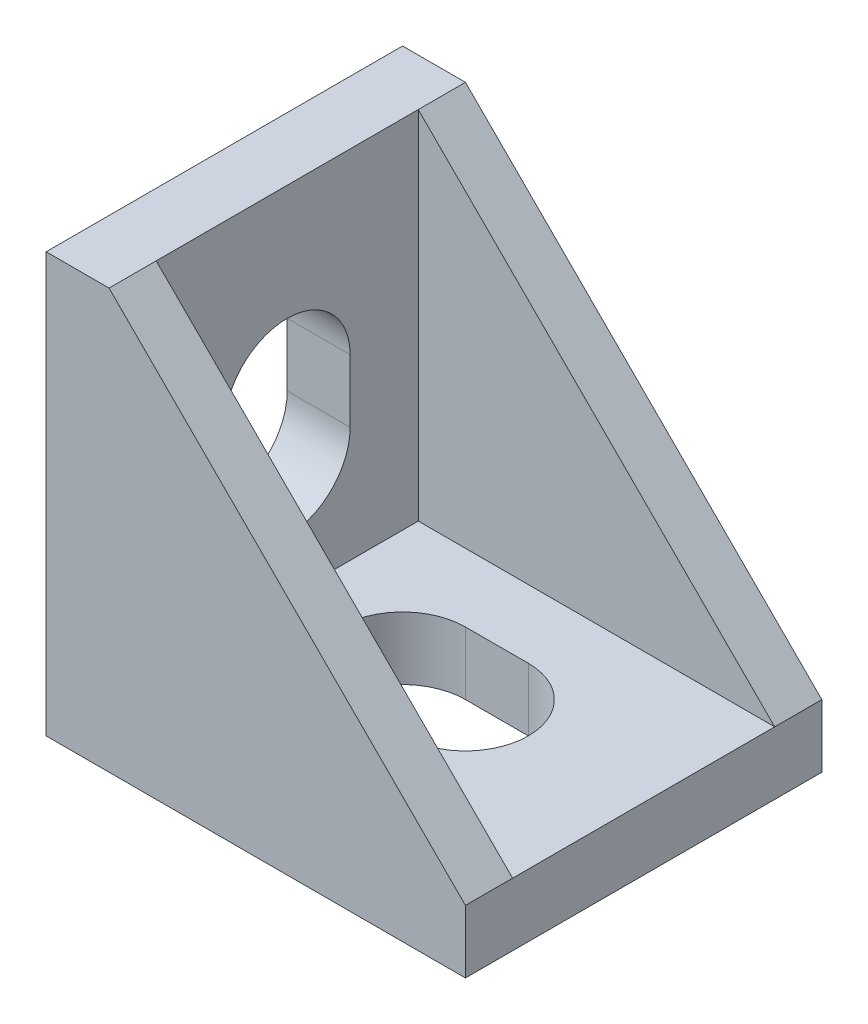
ISO-10303-21;
HEADER;
FILE_DESCRIPTION(('STEP AP214'),'2;1');
FILE_NAME('part.step','',(''),(''),'','','');
FILE_SCHEMA(('AUTOMOTIVE_DESIGN { 1 0 10303 214 1 1 1 1 }'));
ENDSEC;
DATA;
#1=APPLICATION_CONTEXT('core data for automotive mechanical design processes');
#2=APPLICATION_PROTOCOL_DEFINITION('international standard','automotive_design',2000,#1);
#3=PRODUCT_CONTEXT('',#1,'mechanical');
#4=PRODUCT('Part','Part','',(#3));
#5=PRODUCT_RELATED_PRODUCT_CATEGORY('part','',(#4));
#6=PRODUCT_DEFINITION_FORMATION('','',#4);
#7=PRODUCT_DEFINITION_CONTEXT('part definition',#1,'design');
#8=PRODUCT_DEFINITION('design','',#6,#7);
#9=PRODUCT_DEFINITION_SHAPE('','',#8);
#10=(LENGTH_UNIT() NAMED_UNIT(*) SI_UNIT(.MILLI.,.METRE.));
#11=(NAMED_UNIT(*) PLANE_ANGLE_UNIT() SI_UNIT($,.RADIAN.));
#12=(NAMED_UNIT(*) SI_UNIT($,.STERADIAN.) SOLID_ANGLE_UNIT());
#13=UNCERTAINTY_MEASURE_WITH_UNIT(LENGTH_MEASURE(1.E-05),#10,'distance_accuracy_value','');
#14=(GEOMETRIC_REPRESENTATION_CONTEXT(3) GLOBAL_UNCERTAINTY_ASSIGNED_CONTEXT((#13)) GLOBAL_UNIT_ASSIGNED_CONTEXT((#10,
#11,#12)) REPRESENTATION_CONTEXT('',''));
#15=CARTESIAN_POINT('',(0.,0.,0.));
#16=DIRECTION('',(0.,0.,1.));
#17=DIRECTION('',(1.,0.,0.));
#18=AXIS2_PLACEMENT_3D('',#15,#16,#17);
#19=CARTESIAN_POINT('',(-10.,-10.,8.5));
#20=DIRECTION('',(0.,1.,0.));
#21=DIRECTION('',(-1.,0.,0.));
#22=AXIS2_PLACEMENT_3D('',#19,#20,#21);
#23=PLANE('',#22);
#24=DIRECTION('',(0.,0.,-1.));
#25=VECTOR('',#24,1.);
#26=CARTESIAN_POINT('',(-7.,-10.,-1.8));
#27=LINE('',#26,#25);
#28=CARTESIAN_POINT('',(-7.,-10.,1.8));
#29=VERTEX_POINT('',#28);
#30=CARTESIAN_POINT('',(-7.,-10.,-1.8));
#31=VERTEX_POINT('',#30);
#32=EDGE_CURVE('E275',#29,#31,#27,.T.);
#33=ORIENTED_EDGE('',*,*,#32,.T.);
#34=DIRECTION('',(-1.,0.,0.));
#35=VECTOR('',#34,1.);
#36=CARTESIAN_POINT('',(-7.,-10.,-1.8));
#37=LINE('',#36,#35);
#38=CARTESIAN_POINT('',(-8.5,-10.,-1.8));
#39=VERTEX_POINT('',#38);
#40=EDGE_CURVE('E249',#31,#39,#37,.T.);
#41=ORIENTED_EDGE('',*,*,#40,.T.);
#42=DIRECTION('',(0.,0.,1.));
#43=VECTOR('',#42,1.);
#44=CARTESIAN_POINT('',(-8.5,-10.,-1.8));
#45=LINE('',#44,#43);
#46=CARTESIAN_POINT('',(-8.5,-10.,1.8));
#47=VERTEX_POINT('',#46);
#48=EDGE_CURVE('E265',#39,#47,#45,.T.);
#49=ORIENTED_EDGE('',*,*,#48,.T.);
#50=DIRECTION('',(1.,0.,0.));
#51=VECTOR('',#50,1.);
#52=CARTESIAN_POINT('',(-7.,-10.,1.8));
#53=LINE('',#52,#51);
#54=EDGE_CURVE('E49',#47,#29,#53,.T.);
#55=ORIENTED_EDGE('',*,*,#54,.T.);
#56=EDGE_LOOP('',(#33,#41,#49,#55));
#57=FACE_BOUND('',#56,.T.);
#58=DIRECTION('',(0.,0.,-1.));
#59=VECTOR('',#58,1.);
#60=CARTESIAN_POINT('',(9.,-10.,-1.8));
#61=LINE('',#60,#59);
#62=CARTESIAN_POINT('',(9.,-10.,1.8));
#63=VERTEX_POINT('',#62);
#64=CARTESIAN_POINT('',(9.,-10.,-1.8));
#65=VERTEX_POINT('',#64);
#66=EDGE_CURVE('E300',#63,#65,#61,.T.);
#67=ORIENTED_EDGE('',*,*,#66,.T.);
#68=DIRECTION('',(-1.,0.,0.));
#69=VECTOR('',#68,1.);
#70=CARTESIAN_POINT('',(9.,-10.,-1.8));
#71=LINE('',#70,#69);
#72=CARTESIAN_POINT('',(7.5,-10.,-1.8));
#73=VERTEX_POINT('',#72);
#74=EDGE_CURVE('E254',#65,#73,#71,.T.);
#75=ORIENTED_EDGE('',*,*,#74,.T.);
#76=DIRECTION('',(0.,0.,1.));
#77=VECTOR('',#76,1.);
#78=CARTESIAN_POINT('',(7.5,-10.,-1.8));
#79=LINE('',#78,#77);
#80=CARTESIAN_POINT('',(7.5,-10.,1.8));
#81=VERTEX_POINT('',#80);
#82=EDGE_CURVE('E288',#73,#81,#79,.T.);
#83=ORIENTED_EDGE('',*,*,#82,.T.);
#84=DIRECTION('',(1.,0.,0.));
#85=VECTOR('',#84,1.);
#86=CARTESIAN_POINT('',(9.,-10.,1.8));
#87=LINE('',#86,#85);
#88=EDGE_CURVE('E57',#81,#63,#87,.T.);
#89=ORIENTED_EDGE('',*,*,#88,.T.);
#90=EDGE_LOOP('',(#67,#75,#83,#89));
#91=FACE_BOUND('',#90,.T.);
#92=DIRECTION('',(1.,0.,0.));
#93=VECTOR('',#92,1.);
#94=CARTESIAN_POINT('',(-10.,-10.,-8.5));
#95=LINE('',#94,#93);
#96=CARTESIAN_POINT('',(-10.,-10.,-8.5));
#97=VERTEX_POINT('',#96);
#98=CARTESIAN_POINT('',(10.,-10.,-8.5));
#99=VERTEX_POINT('',#98);
#100=EDGE_CURVE('E467',#97,#99,#95,.T.);
#101=ORIENTED_EDGE('',*,*,#100,.T.);
#102=DIRECTION('',(0.,0.,-1.));
#103=VECTOR('',#102,1.);
#104=CARTESIAN_POINT('',(10.,-10.,8.5));
#105=LINE('',#104,#103);
#106=CARTESIAN_POINT('',(10.,-10.,8.5));
#107=VERTEX_POINT('',#106);
#108=EDGE_CURVE('E475',#107,#99,#105,.T.);
#109=ORIENTED_EDGE('',*,*,#108,.F.);
#110=DIRECTION('',(1.,0.,0.));
#111=VECTOR('',#110,1.);
#112=CARTESIAN_POINT('',(-10.,-10.,8.5));
#113=LINE('',#112,#111);
#114=CARTESIAN_POINT('',(-10.,-10.,8.5));
#115=VERTEX_POINT('',#114);
#116=EDGE_CURVE('E456',#115,#107,#113,.T.);
#117=ORIENTED_EDGE('',*,*,#116,.F.);
#118=DIRECTION('',(0.,0.,-1.));
#119=VECTOR('',#118,1.);
#120=CARTESIAN_POINT('',(-10.,-10.,8.5));
#121=LINE('',#120,#119);
#122=EDGE_CURVE('E478',#115,#97,#121,.T.);
#123=ORIENTED_EDGE('',*,*,#122,.T.);
#124=EDGE_LOOP('',(#101,#109,#117,#123));
#125=FACE_BOUND('',#124,.T.);
#126=CARTESIAN_POINT('',(1.5,-10.,0.));
#127=DIRECTION('',(0.,1.,0.));
#128=DIRECTION('',(-1.,0.,0.));
#129=AXIS2_PLACEMENT_3D('',#126,#127,#128);
#130=CIRCLE('',#129,3.);
#131=CARTESIAN_POINT('',(1.5,-10.,3.));
#132=VERTEX_POINT('',#131);
#133=CARTESIAN_POINT('',(1.5,-10.,-3.));
#134=VERTEX_POINT('',#133);
#135=EDGE_CURVE('E313',#132,#134,#130,.T.);
#136=ORIENTED_EDGE('',*,*,#135,.T.);
#137=DIRECTION('',(-1.,0.,0.));
#138=VECTOR('',#137,1.);
#139=CARTESIAN_POINT('',(1.5,-10.,-3.));
#140=LINE('',#139,#138);
#141=CARTESIAN_POINT('',(-1.5,-10.,-3.));
#142=VERTEX_POINT('',#141);
#143=EDGE_CURVE('E322',#134,#142,#140,.T.);
#144=ORIENTED_EDGE('',*,*,#143,.T.);
#145=CARTESIAN_POINT('',(-1.5,-10.,0.));
#146=DIRECTION('',(0.,1.,0.));
#147=DIRECTION('',(-1.,0.,0.));
#148=AXIS2_PLACEMENT_3D('',#145,#146,#147);
#149=CIRCLE('',#148,3.);
#150=CARTESIAN_POINT('',(-1.5,-10.,3.));
#151=VERTEX_POINT('',#150);
#152=EDGE_CURVE('E319',#142,#151,#149,.T.);
#153=ORIENTED_EDGE('',*,*,#152,.T.);
#154=DIRECTION('',(1.,0.,0.));
#155=VECTOR('',#154,1.);
#156=CARTESIAN_POINT('',(1.5,-10.,3.));
#157=LINE('',#156,#155);
#158=EDGE_CURVE('E316',#151,#132,#157,.T.);
#159=ORIENTED_EDGE('',*,*,#158,.T.);
#160=EDGE_LOOP('',(#136,#144,#153,#159));
#161=FACE_BOUND('',#160,.T.);
#162=ADVANCED_FACE('F34',(#57,#91,#125,#161),#23,.F.);
#163=CARTESIAN_POINT('',(0.,-7.,0.));
#164=DIRECTION('',(0.,1.,0.));
#165=DIRECTION('',(-1.,0.,0.));
#166=AXIS2_PLACEMENT_3D('',#163,#164,#165);
#167=PLANE('',#166);
#168=DIRECTION('',(0.,0.,1.));
#169=VECTOR('',#168,1.);
#170=CARTESIAN_POINT('',(-7.,-7.,-6.25));
#171=LINE('',#170,#169);
#172=CARTESIAN_POINT('',(-7.,-7.,-6.25));
#173=VERTEX_POINT('',#172);
#174=CARTESIAN_POINT('',(-7.,-7.,6.25));
#175=VERTEX_POINT('',#174);
#176=EDGE_CURVE('E421',#173,#175,#171,.T.);
#177=ORIENTED_EDGE('',*,*,#176,.T.);
#178=DIRECTION('',(1.,0.,0.));
#179=VECTOR('',#178,1.);
#180=CARTESIAN_POINT('',(-7.,-7.,6.25));
#181=LINE('',#180,#179);
#182=CARTESIAN_POINT('',(10.,-7.,6.25));
#183=VERTEX_POINT('',#182);
#184=EDGE_CURVE('E424',#175,#183,#181,.T.);
#185=ORIENTED_EDGE('',*,*,#184,.T.);
#186=DIRECTION('',(0.,0.,-1.));
#187=VECTOR('',#186,1.);
#188=CARTESIAN_POINT('',(10.,-7.,-6.25));
#189=LINE('',#188,#187);
#190=CARTESIAN_POINT('',(10.,-7.,-6.25));
#191=VERTEX_POINT('',#190);
#192=EDGE_CURVE('E427',#183,#191,#189,.T.);
#193=ORIENTED_EDGE('',*,*,#192,.T.);
#194=DIRECTION('',(-1.,0.,0.));
#195=VECTOR('',#194,1.);
#196=CARTESIAN_POINT('',(-7.,-7.,-6.25));
#197=LINE('',#196,#195);
#198=EDGE_CURVE('E429',#191,#173,#197,.T.);
#199=ORIENTED_EDGE('',*,*,#198,.T.);
#200=EDGE_LOOP('',(#177,#185,#193,#199));
#201=FACE_BOUND('',#200,.T.);
#202=DIRECTION('',(1.,0.,0.));
#203=VECTOR('',#202,1.);
#204=CARTESIAN_POINT('',(0.,-7.,-3.));
#205=LINE('',#204,#203);
#206=CARTESIAN_POINT('',(-1.5,-7.,-3.));
#207=VERTEX_POINT('',#206);
#208=CARTESIAN_POINT('',(1.5,-7.,-3.));
#209=VERTEX_POINT('',#208);
#210=EDGE_CURVE('E42',#207,#209,#205,.T.);
#211=ORIENTED_EDGE('',*,*,#210,.T.);
#212=CARTESIAN_POINT('',(1.5,-7.,0.));
#213=DIRECTION('',(0.,1.,0.));
#214=DIRECTION('',(-1.,0.,0.));
#215=AXIS2_PLACEMENT_3D('',#212,#213,#214);
#216=CIRCLE('',#215,3.);
#217=CARTESIAN_POINT('',(1.5,-7.,3.));
#218=VERTEX_POINT('',#217);
#219=EDGE_CURVE('E11',#209,#218,#216,.F.);
#220=ORIENTED_EDGE('',*,*,#219,.T.);
#221=DIRECTION('',(-1.,0.,0.));
#222=VECTOR('',#221,1.);
#223=CARTESIAN_POINT('',(0.,-7.,3.));
#224=LINE('',#223,#222);
#225=CARTESIAN_POINT('',(-1.5,-7.,3.));
#226=VERTEX_POINT('',#225);
#227=EDGE_CURVE('E499',#218,#226,#224,.T.);
#228=ORIENTED_EDGE('',*,*,#227,.T.);
#229=CARTESIAN_POINT('',(-1.5,-7.,0.));
#230=DIRECTION('',(0.,1.,0.));
#231=DIRECTION('',(-1.,0.,0.));
#232=AXIS2_PLACEMENT_3D('',#229,#230,#231);
#233=CIRCLE('',#232,3.);
#234=EDGE_CURVE('E502',#226,#207,#233,.F.);
#235=ORIENTED_EDGE('',*,*,#234,.T.);
#236=EDGE_LOOP('',(#211,#220,#228,#235));
#237=FACE_BOUND('',#236,.T.);
#238=ADVANCED_FACE('F506',(#201,#237),#167,.T.);
#239=CARTESIAN_POINT('',(-10.,10.,8.5));
#240=DIRECTION('',(1.,0.,0.));
#241=DIRECTION('',(0.,1.,0.));
#242=AXIS2_PLACEMENT_3D('',#239,#240,#241);
#243=PLANE('',#242);
#244=DIRECTION('',(0.,-1.,0.));
#245=VECTOR('',#244,1.);
#246=CARTESIAN_POINT('',(-10.,9.00000000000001,-1.8));
#247=LINE('',#246,#245);
#248=CARTESIAN_POINT('',(-10.,9.00000000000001,-1.8));
#249=VERTEX_POINT('',#248);
#250=CARTESIAN_POINT('',(-10.,7.5,-1.8));
#251=VERTEX_POINT('',#250);
#252=EDGE_CURVE('E367',#249,#251,#247,.T.);
#253=ORIENTED_EDGE('',*,*,#252,.F.);
#254=DIRECTION('',(0.,0.,-1.));
#255=VECTOR('',#254,1.);
#256=CARTESIAN_POINT('',(-10.,9.00000000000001,-1.8));
#257=LINE('',#256,#255);
#258=CARTESIAN_POINT('',(-10.,9.00000000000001,1.8));
#259=VERTEX_POINT('',#258);
#260=EDGE_CURVE('E372',#259,#249,#257,.T.);
#261=ORIENTED_EDGE('',*,*,#260,.F.);
#262=DIRECTION('',(0.,1.,0.));
#263=VECTOR('',#262,1.);
#264=CARTESIAN_POINT('',(-10.,9.00000000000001,1.8));
#265=LINE('',#264,#263);
#266=CARTESIAN_POINT('',(-10.,7.50000000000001,1.8));
#267=VERTEX_POINT('',#266);
#268=EDGE_CURVE('E384',#267,#259,#265,.T.);
#269=ORIENTED_EDGE('',*,*,#268,.F.);
#270=DIRECTION('',(0.,0.,1.));
#271=VECTOR('',#270,1.);
#272=CARTESIAN_POINT('',(-10.,7.5,-1.8));
#273=LINE('',#272,#271);
#274=EDGE_CURVE('E381',#251,#267,#273,.T.);
#275=ORIENTED_EDGE('',*,*,#274,.F.);
#276=EDGE_LOOP('',(#253,#261,#269,#275));
#277=FACE_BOUND('',#276,.T.);
#278=DIRECTION('',(0.,-1.,0.));
#279=VECTOR('',#278,1.);
#280=CARTESIAN_POINT('',(-10.,1.5,-3.));
#281=LINE('',#280,#279);
#282=CARTESIAN_POINT('',(-10.,1.5,-3.));
#283=VERTEX_POINT('',#282);
#284=CARTESIAN_POINT('',(-10.,-1.5,-3.));
#285=VERTEX_POINT('',#284);
#286=EDGE_CURVE('E402',#283,#285,#281,.T.);
#287=ORIENTED_EDGE('',*,*,#286,.F.);
#288=CARTESIAN_POINT('',(-10.,1.5,0.));
#289=DIRECTION('',(-1.,0.,0.));
#290=DIRECTION('',(0.,-1.,0.));
#291=AXIS2_PLACEMENT_3D('',#288,#289,#290);
#292=CIRCLE('',#291,3.);
#293=CARTESIAN_POINT('',(-10.,1.5,3.));
#294=VERTEX_POINT('',#293);
#295=EDGE_CURVE('E400',#294,#283,#292,.T.);
#296=ORIENTED_EDGE('',*,*,#295,.F.);
#297=DIRECTION('',(0.,1.,0.));
#298=VECTOR('',#297,1.);
#299=CARTESIAN_POINT('',(-10.,1.5,3.));
#300=LINE('',#299,#298);
#301=CARTESIAN_POINT('',(-10.,-1.5,3.));
#302=VERTEX_POINT('',#301);
#303=EDGE_CURVE('E408',#302,#294,#300,.T.);
#304=ORIENTED_EDGE('',*,*,#303,.F.);
#305=CARTESIAN_POINT('',(-10.,-1.5,0.));
#306=DIRECTION('',(-1.,0.,0.));
#307=DIRECTION('',(0.,-1.,0.));
#308=AXIS2_PLACEMENT_3D('',#305,#306,#307);
#309=CIRCLE('',#308,3.);
#310=EDGE_CURVE('E405',#285,#302,#309,.T.);
#311=ORIENTED_EDGE('',*,*,#310,.F.);
#312=EDGE_LOOP('',(#287,#296,#304,#311));
#313=FACE_BOUND('',#312,.T.);
#314=DIRECTION('',(0.,-1.,0.));
#315=VECTOR('',#314,1.);
#316=CARTESIAN_POINT('',(-10.,10.,-8.5));
#317=LINE('',#316,#315);
#318=CARTESIAN_POINT('',(-10.,10.,-8.5));
#319=VERTEX_POINT('',#318);
#320=EDGE_CURVE('E448',#319,#97,#317,.T.);
#321=ORIENTED_EDGE('',*,*,#320,.T.);
#322=ORIENTED_EDGE('',*,*,#122,.F.);
#323=DIRECTION('',(0.,-1.,0.));
#324=VECTOR('',#323,1.);
#325=CARTESIAN_POINT('',(-10.,10.,8.5));
#326=LINE('',#325,#324);
#327=CARTESIAN_POINT('',(-10.,10.,8.5));
#328=VERTEX_POINT('',#327);
#329=EDGE_CURVE('E453',#328,#115,#326,.T.);
#330=ORIENTED_EDGE('',*,*,#329,.F.);
#331=DIRECTION('',(0.,0.,-1.));
#332=VECTOR('',#331,1.);
#333=CARTESIAN_POINT('',(-10.,10.,8.5));
#334=LINE('',#333,#332);
#335=EDGE_CURVE('E464',#328,#319,#334,.T.);
#336=ORIENTED_EDGE('',*,*,#335,.T.);
#337=EDGE_LOOP('',(#321,#322,#330,#336));
#338=FACE_BOUND('',#337,.T.);
#339=DIRECTION('',(0.,-1.,0.));
#340=VECTOR('',#339,1.);
#341=CARTESIAN_POINT('',(-10.,-7.,-1.8));
#342=LINE('',#341,#340);
#343=CARTESIAN_POINT('',(-10.,-7.,-1.8));
#344=VERTEX_POINT('',#343);
#345=CARTESIAN_POINT('',(-10.,-8.5,-1.8));
#346=VERTEX_POINT('',#345);
#347=EDGE_CURVE('E328',#344,#346,#342,.T.);
#348=ORIENTED_EDGE('',*,*,#347,.F.);
#349=DIRECTION('',(0.,0.,-1.));
#350=VECTOR('',#349,1.);
#351=CARTESIAN_POINT('',(-10.,-7.,-1.8));
#352=LINE('',#351,#350);
#353=CARTESIAN_POINT('',(-10.,-7.,1.8));
#354=VERTEX_POINT('',#353);
#355=EDGE_CURVE('E339',#354,#344,#352,.T.);
#356=ORIENTED_EDGE('',*,*,#355,.F.);
#357=DIRECTION('',(0.,1.,0.));
#358=VECTOR('',#357,1.);
#359=CARTESIAN_POINT('',(-10.,-7.,1.8));
#360=LINE('',#359,#358);
#361=CARTESIAN_POINT('',(-10.,-8.5,1.8));
#362=VERTEX_POINT('',#361);
#363=EDGE_CURVE('E351',#362,#354,#360,.T.);
#364=ORIENTED_EDGE('',*,*,#363,.F.);
#365=DIRECTION('',(0.,0.,1.));
#366=VECTOR('',#365,1.);
#367=CARTESIAN_POINT('',(-10.,-8.5,-1.8));
#368=LINE('',#367,#366);
#369=EDGE_CURVE('E348',#346,#362,#368,.T.);
#370=ORIENTED_EDGE('',*,*,#369,.F.);
#371=EDGE_LOOP('',(#348,#356,#364,#370));
#372=FACE_BOUND('',#371,.T.);
#373=ADVANCED_FACE('F36',(#277,#313,#338,#372),#243,.F.);
#374=CARTESIAN_POINT('',(10.,-7.,8.5));
#375=DIRECTION('',(-0.707106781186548,-0.707106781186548,0.));
#376=DIRECTION('',(0.707106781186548,-0.707106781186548,0.));
#377=AXIS2_PLACEMENT_3D('',#374,#375,#376);
#378=PLANE('',#377);
#379=DIRECTION('',(0.,0.,-1.));
#380=VECTOR('',#379,1.);
#381=CARTESIAN_POINT('',(-7.,10.,8.5));
#382=LINE('',#381,#380);
#383=CARTESIAN_POINT('',(-7.,10.,-6.25));
#384=VERTEX_POINT('',#383);
#385=CARTESIAN_POINT('',(-7.,10.,-8.5));
#386=VERTEX_POINT('',#385);
#387=EDGE_CURVE('E442',#384,#386,#382,.T.);
#388=ORIENTED_EDGE('',*,*,#387,.F.);
#389=DIRECTION('',(0.707106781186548,-0.707106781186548,0.));
#390=VECTOR('',#389,1.);
#391=CARTESIAN_POINT('',(10.,-7.,-6.25));
#392=LINE('',#391,#390);
#393=EDGE_CURVE('E484',#384,#191,#392,.T.);
#394=ORIENTED_EDGE('',*,*,#393,.T.);
#395=DIRECTION('',(0.,0.,-1.));
#396=VECTOR('',#395,1.);
#397=CARTESIAN_POINT('',(10.,-7.,8.5));
#398=LINE('',#397,#396);
#399=CARTESIAN_POINT('',(10.,-7.,-8.5));
#400=VERTEX_POINT('',#399);
#401=EDGE_CURVE('E449',#191,#400,#398,.T.);
#402=ORIENTED_EDGE('',*,*,#401,.T.);
#403=DIRECTION('',(-0.707106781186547,0.707106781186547,0.));
#404=VECTOR('',#403,1.);
#405=CARTESIAN_POINT('',(10.,-7.,-8.5));
#406=LINE('',#405,#404);
#407=EDGE_CURVE('E437',#400,#386,#406,.T.);
#408=ORIENTED_EDGE('',*,*,#407,.T.);
#409=EDGE_LOOP('',(#388,#394,#402,#408));
#410=FACE_BOUND('',#409,.T.);
#411=ADVANCED_FACE('F548',(#410),#378,.F.);
#412=CARTESIAN_POINT('',(10.,10.,8.5));
#413=DIRECTION('',(-1.,0.,0.));
#414=DIRECTION('',(0.,-1.,0.));
#415=AXIS2_PLACEMENT_3D('',#412,#413,#414);
#416=PLANE('',#415);
#417=DIRECTION('',(0.,1.,0.));
#418=VECTOR('',#417,1.);
#419=CARTESIAN_POINT('',(10.,10.,-8.5));
#420=LINE('',#419,#418);
#421=EDGE_CURVE('E469',#99,#400,#420,.T.);
#422=ORIENTED_EDGE('',*,*,#421,.T.);
#423=ORIENTED_EDGE('',*,*,#401,.F.);
#424=ORIENTED_EDGE('',*,*,#192,.F.);
#425=CARTESIAN_POINT('',(10.,-7.,8.5));
#426=VERTEX_POINT('',#425);
#427=EDGE_CURVE('E445',#426,#183,#398,.T.);
#428=ORIENTED_EDGE('',*,*,#427,.F.);
#429=DIRECTION('',(0.,1.,0.));
#430=VECTOR('',#429,1.);
#431=CARTESIAN_POINT('',(10.,10.,8.5));
#432=LINE('',#431,#430);
#433=EDGE_CURVE('E459',#107,#426,#432,.T.);
#434=ORIENTED_EDGE('',*,*,#433,.F.);
#435=ORIENTED_EDGE('',*,*,#108,.T.);
#436=EDGE_LOOP('',(#422,#423,#424,#428,#434,#435));
#437=FACE_BOUND('',#436,.T.);
#438=ADVANCED_FACE('F544',(#437),#416,.F.);
#439=CARTESIAN_POINT('',(-10.,10.,8.5));
#440=DIRECTION('',(0.,-1.,0.));
#441=DIRECTION('',(1.,0.,0.));
#442=AXIS2_PLACEMENT_3D('',#439,#440,#441);
#443=PLANE('',#442);
#444=DIRECTION('',(-1.,0.,0.));
#445=VECTOR('',#444,1.);
#446=CARTESIAN_POINT('',(-10.,10.,8.5));
#447=LINE('',#446,#445);
#448=CARTESIAN_POINT('',(-7.,10.,8.5));
#449=VERTEX_POINT('',#448);
#450=EDGE_CURVE('E462',#449,#328,#447,.T.);
#451=ORIENTED_EDGE('',*,*,#450,.F.);
#452=CARTESIAN_POINT('',(-7.,10.,6.25));
#453=VERTEX_POINT('',#452);
#454=EDGE_CURVE('E450',#449,#453,#382,.T.);
#455=ORIENTED_EDGE('',*,*,#454,.T.);
#456=DIRECTION('',(0.,0.,1.));
#457=VECTOR('',#456,1.);
#458=CARTESIAN_POINT('',(-7.,10.,-6.25));
#459=LINE('',#458,#457);
#460=EDGE_CURVE('E414',#384,#453,#459,.T.);
#461=ORIENTED_EDGE('',*,*,#460,.F.);
#462=ORIENTED_EDGE('',*,*,#387,.T.);
#463=DIRECTION('',(-1.,0.,0.));
#464=VECTOR('',#463,1.);
#465=CARTESIAN_POINT('',(-10.,10.,-8.5));
#466=LINE('',#465,#464);
#467=EDGE_CURVE('E457',#386,#319,#466,.T.);
#468=ORIENTED_EDGE('',*,*,#467,.T.);
#469=ORIENTED_EDGE('',*,*,#335,.F.);
#470=EDGE_LOOP('',(#451,#455,#461,#462,#468,#469));
#471=FACE_BOUND('',#470,.T.);
#472=ADVANCED_FACE('F547',(#471),#443,.F.);
#473=CARTESIAN_POINT('',(0.,0.,8.5));
#474=DIRECTION('',(0.,0.,1.));
#475=DIRECTION('',(1.,0.,0.));
#476=AXIS2_PLACEMENT_3D('',#473,#474,#475);
#477=PLANE('',#476);
#478=DIRECTION('',(-0.707106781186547,0.707106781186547,0.));
#479=VECTOR('',#478,1.);
#480=CARTESIAN_POINT('',(10.,-7.,8.5));
#481=LINE('',#480,#479);
#482=EDGE_CURVE('E439',#426,#449,#481,.T.);
#483=ORIENTED_EDGE('',*,*,#482,.T.);
#484=ORIENTED_EDGE('',*,*,#450,.T.);
#485=ORIENTED_EDGE('',*,*,#329,.T.);
#486=ORIENTED_EDGE('',*,*,#116,.T.);
#487=ORIENTED_EDGE('',*,*,#433,.T.);
#488=EDGE_LOOP('',(#483,#484,#485,#486,#487));
#489=FACE_BOUND('',#488,.T.);
#490=ADVANCED_FACE('F552',(#489),#477,.T.);
#491=CARTESIAN_POINT('',(0.,0.,-8.5));
#492=DIRECTION('',(0.,0.,1.));
#493=DIRECTION('',(1.,0.,0.));
#494=AXIS2_PLACEMENT_3D('',#491,#492,#493);
#495=PLANE('',#494);
#496=ORIENTED_EDGE('',*,*,#467,.F.);
#497=ORIENTED_EDGE('',*,*,#407,.F.);
#498=ORIENTED_EDGE('',*,*,#421,.F.);
#499=ORIENTED_EDGE('',*,*,#100,.F.);
#500=ORIENTED_EDGE('',*,*,#320,.F.);
#501=EDGE_LOOP('',(#496,#497,#498,#499,#500));
#502=FACE_BOUND('',#501,.T.);
#503=ADVANCED_FACE('F554',(#502),#495,.F.);
#504=ORIENTED_EDGE('',*,*,#427,.T.);
#505=DIRECTION('',(-0.707106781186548,0.707106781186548,0.));
#506=VECTOR('',#505,1.);
#507=CARTESIAN_POINT('',(10.,-7.,6.25));
#508=LINE('',#507,#506);
#509=EDGE_CURVE('E481',#183,#453,#508,.T.);
#510=ORIENTED_EDGE('',*,*,#509,.T.);
#511=ORIENTED_EDGE('',*,*,#454,.F.);
#512=ORIENTED_EDGE('',*,*,#482,.F.);
#513=EDGE_LOOP('',(#504,#510,#511,#512));
#514=FACE_BOUND('',#513,.T.);
#515=ADVANCED_FACE('F557',(#514),#378,.F.);
#516=CARTESIAN_POINT('',(-7.,-7.,-6.25));
#517=DIRECTION('',(0.,0.,-1.));
#518=DIRECTION('',(-1.,0.,0.));
#519=AXIS2_PLACEMENT_3D('',#516,#517,#518);
#520=PLANE('',#519);
#521=DIRECTION('',(0.,1.,0.));
#522=VECTOR('',#521,1.);
#523=CARTESIAN_POINT('',(-7.,-7.,-6.25));
#524=LINE('',#523,#522);
#525=EDGE_CURVE('E435',#173,#384,#524,.T.);
#526=ORIENTED_EDGE('',*,*,#525,.F.);
#527=ORIENTED_EDGE('',*,*,#198,.F.);
#528=ORIENTED_EDGE('',*,*,#393,.F.);
#529=EDGE_LOOP('',(#526,#527,#528));
#530=FACE_BOUND('',#529,.T.);
#531=ADVANCED_FACE('F564',(#530),#520,.F.);
#532=CARTESIAN_POINT('',(-7.,-7.,6.25));
#533=DIRECTION('',(0.,0.,1.));
#534=DIRECTION('',(1.,0.,0.));
#535=AXIS2_PLACEMENT_3D('',#532,#533,#534);
#536=PLANE('',#535);
#537=ORIENTED_EDGE('',*,*,#184,.F.);
#538=DIRECTION('',(0.,1.,0.));
#539=VECTOR('',#538,1.);
#540=CARTESIAN_POINT('',(-7.,-7.,6.25));
#541=LINE('',#540,#539);
#542=EDGE_CURVE('E432',#175,#453,#541,.T.);
#543=ORIENTED_EDGE('',*,*,#542,.T.);
#544=ORIENTED_EDGE('',*,*,#509,.F.);
#545=EDGE_LOOP('',(#537,#543,#544));
#546=FACE_BOUND('',#545,.T.);
#547=ADVANCED_FACE('F570',(#546),#536,.F.);
#548=CARTESIAN_POINT('',(-7.,-7.,-6.25));
#549=DIRECTION('',(-1.,0.,0.));
#550=DIRECTION('',(0.,0.,1.));
#551=AXIS2_PLACEMENT_3D('',#548,#549,#550);
#552=PLANE('',#551);
#553=DIRECTION('',(0.,1.,0.));
#554=VECTOR('',#553,1.);
#555=CARTESIAN_POINT('',(-7.,-7.,3.));
#556=LINE('',#555,#554);
#557=CARTESIAN_POINT('',(-7.,-1.5,3.));
#558=VERTEX_POINT('',#557);
#559=CARTESIAN_POINT('',(-7.,1.5,3.));
#560=VERTEX_POINT('',#559);
#561=EDGE_CURVE('E493',#558,#560,#556,.T.);
#562=ORIENTED_EDGE('',*,*,#561,.T.);
#563=CARTESIAN_POINT('',(-7.,1.5,0.));
#564=DIRECTION('',(-1.,0.,0.));
#565=DIRECTION('',(0.,0.,1.));
#566=AXIS2_PLACEMENT_3D('',#563,#564,#565);
#567=CIRCLE('',#566,3.);
#568=CARTESIAN_POINT('',(-7.,1.5,-3.));
#569=VERTEX_POINT('',#568);
#570=EDGE_CURVE('E496',#560,#569,#567,.T.);
#571=ORIENTED_EDGE('',*,*,#570,.T.);
#572=DIRECTION('',(0.,-1.,0.));
#573=VECTOR('',#572,1.);
#574=CARTESIAN_POINT('',(-7.,-7.,-3.));
#575=LINE('',#574,#573);
#576=CARTESIAN_POINT('',(-7.,-1.5,-3.));
#577=VERTEX_POINT('',#576);
#578=EDGE_CURVE('E487',#569,#577,#575,.T.);
#579=ORIENTED_EDGE('',*,*,#578,.T.);
#580=CARTESIAN_POINT('',(-7.,-1.5,0.));
#581=DIRECTION('',(-1.,0.,0.));
#582=DIRECTION('',(0.,0.,1.));
#583=AXIS2_PLACEMENT_3D('',#580,#581,#582);
#584=CIRCLE('',#583,3.);
#585=EDGE_CURVE('E490',#577,#558,#584,.T.);
#586=ORIENTED_EDGE('',*,*,#585,.T.);
#587=EDGE_LOOP('',(#562,#571,#579,#586));
#588=FACE_BOUND('',#587,.T.);
#589=ORIENTED_EDGE('',*,*,#460,.T.);
#590=ORIENTED_EDGE('',*,*,#542,.F.);
#591=ORIENTED_EDGE('',*,*,#176,.F.);
#592=ORIENTED_EDGE('',*,*,#525,.T.);
#593=EDGE_LOOP('',(#589,#590,#591,#592));
#594=FACE_BOUND('',#593,.T.);
#595=ADVANCED_FACE('F566',(#588,#594),#552,.F.);
#596=CARTESIAN_POINT('',(7.,1.5,0.));
#597=DIRECTION('',(-1.,0.,0.));
#598=DIRECTION('',(0.,-1.,0.));
#599=AXIS2_PLACEMENT_3D('',#596,#597,#598);
#600=CYLINDRICAL_SURFACE('',#599,3.);
#601=DIRECTION('',(-1.,0.,0.));
#602=VECTOR('',#601,1.);
#603=CARTESIAN_POINT('',(7.,1.5,3.));
#604=LINE('',#603,#602);
#605=EDGE_CURVE('E412',#560,#294,#604,.T.);
#606=ORIENTED_EDGE('',*,*,#605,.T.);
#607=ORIENTED_EDGE('',*,*,#295,.T.);
#608=DIRECTION('',(-1.,0.,0.));
#609=VECTOR('',#608,1.);
#610=CARTESIAN_POINT('',(7.,1.5,-3.));
#611=LINE('',#610,#609);
#612=EDGE_CURVE('E411',#569,#283,#611,.T.);
#613=ORIENTED_EDGE('',*,*,#612,.F.);
#614=ORIENTED_EDGE('',*,*,#570,.F.);
#615=EDGE_LOOP('',(#606,#607,#613,#614));
#616=FACE_BOUND('',#615,.T.);
#617=ADVANCED_FACE('F569',(#616),#600,.F.);
#618=CARTESIAN_POINT('',(7.,1.5,3.));
#619=DIRECTION('',(0.,0.,1.));
#620=DIRECTION('',(0.,-1.,0.));
#621=AXIS2_PLACEMENT_3D('',#618,#619,#620);
#622=PLANE('',#621);
#623=DIRECTION('',(-1.,0.,0.));
#624=VECTOR('',#623,1.);
#625=CARTESIAN_POINT('',(7.,-1.5,3.));
#626=LINE('',#625,#624);
#627=EDGE_CURVE('E415',#558,#302,#626,.T.);
#628=ORIENTED_EDGE('',*,*,#627,.T.);
#629=ORIENTED_EDGE('',*,*,#303,.T.);
#630=ORIENTED_EDGE('',*,*,#605,.F.);
#631=ORIENTED_EDGE('',*,*,#561,.F.);
#632=EDGE_LOOP('',(#628,#629,#630,#631));
#633=FACE_BOUND('',#632,.T.);
#634=ADVANCED_FACE('F580',(#633),#622,.F.);
#635=CARTESIAN_POINT('',(7.,-1.5,0.));
#636=DIRECTION('',(-1.,0.,0.));
#637=DIRECTION('',(0.,-1.,0.));
#638=AXIS2_PLACEMENT_3D('',#635,#636,#637);
#639=CYLINDRICAL_SURFACE('',#638,3.);
#640=DIRECTION('',(-1.,0.,0.));
#641=VECTOR('',#640,1.);
#642=CARTESIAN_POINT('',(7.,-1.5,-3.));
#643=LINE('',#642,#641);
#644=EDGE_CURVE('E417',#577,#285,#643,.T.);
#645=ORIENTED_EDGE('',*,*,#644,.T.);
#646=ORIENTED_EDGE('',*,*,#310,.T.);
#647=ORIENTED_EDGE('',*,*,#627,.F.);
#648=ORIENTED_EDGE('',*,*,#585,.F.);
#649=EDGE_LOOP('',(#645,#646,#647,#648));
#650=FACE_BOUND('',#649,.T.);
#651=ADVANCED_FACE('F586',(#650),#639,.F.);
#652=CARTESIAN_POINT('',(7.,1.5,-3.));
#653=DIRECTION('',(0.,0.,-1.));
#654=DIRECTION('',(0.,1.,0.));
#655=AXIS2_PLACEMENT_3D('',#652,#653,#654);
#656=PLANE('',#655);
#657=ORIENTED_EDGE('',*,*,#612,.T.);
#658=ORIENTED_EDGE('',*,*,#286,.T.);
#659=ORIENTED_EDGE('',*,*,#644,.F.);
#660=ORIENTED_EDGE('',*,*,#578,.F.);
#661=EDGE_LOOP('',(#657,#658,#659,#660));
#662=FACE_BOUND('',#661,.T.);
#663=ADVANCED_FACE('F582',(#662),#656,.F.);
#664=CARTESIAN_POINT('',(-11.,9.00000000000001,-1.8));
#665=DIRECTION('',(0.,0.,1.));
#666=DIRECTION('',(0.,-1.,0.));
#667=AXIS2_PLACEMENT_3D('',#664,#665,#666);
#668=PLANE('',#667);
#669=ORIENTED_EDGE('',*,*,#252,.T.);
#670=DIRECTION('',(1.,0.,0.));
#671=VECTOR('',#670,1.);
#672=CARTESIAN_POINT('',(-11.,7.5,-1.8));
#673=LINE('',#672,#671);
#674=CARTESIAN_POINT('',(-11.,7.5,-1.8));
#675=VERTEX_POINT('',#674);
#676=EDGE_CURVE('E397',#675,#251,#673,.T.);
#677=ORIENTED_EDGE('',*,*,#676,.F.);
#678=DIRECTION('',(0.,-1.,0.));
#679=VECTOR('',#678,1.);
#680=CARTESIAN_POINT('',(-11.,9.00000000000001,-1.8));
#681=LINE('',#680,#679);
#682=CARTESIAN_POINT('',(-11.,9.00000000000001,-1.8));
#683=VERTEX_POINT('',#682);
#684=EDGE_CURVE('E368',#683,#675,#681,.T.);
#685=ORIENTED_EDGE('',*,*,#684,.F.);
#686=DIRECTION('',(1.,0.,0.));
#687=VECTOR('',#686,1.);
#688=CARTESIAN_POINT('',(-11.,9.00000000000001,-1.8));
#689=LINE('',#688,#687);
#690=EDGE_CURVE('E378',#683,#249,#689,.T.);
#691=ORIENTED_EDGE('',*,*,#690,.T.);
#692=EDGE_LOOP('',(#669,#677,#685,#691));
#693=FACE_BOUND('',#692,.T.);
#694=ADVANCED_FACE('F585',(#693),#668,.F.);
#695=CARTESIAN_POINT('',(-11.,7.5,-1.8));
#696=DIRECTION('',(0.,1.,0.));
#697=DIRECTION('',(0.,0.,1.));
#698=AXIS2_PLACEMENT_3D('',#695,#696,#697);
#699=PLANE('',#698);
#700=ORIENTED_EDGE('',*,*,#274,.T.);
#701=DIRECTION('',(1.,0.,0.));
#702=VECTOR('',#701,1.);
#703=CARTESIAN_POINT('',(-11.,7.50000000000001,1.8));
#704=LINE('',#703,#702);
#705=CARTESIAN_POINT('',(-11.,7.50000000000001,1.8));
#706=VERTEX_POINT('',#705);
#707=EDGE_CURVE('E394',#706,#267,#704,.T.);
#708=ORIENTED_EDGE('',*,*,#707,.F.);
#709=DIRECTION('',(0.,0.,1.));
#710=VECTOR('',#709,1.);
#711=CARTESIAN_POINT('',(-11.,7.5,-1.8));
#712=LINE('',#711,#710);
#713=EDGE_CURVE('E371',#675,#706,#712,.T.);
#714=ORIENTED_EDGE('',*,*,#713,.F.);
#715=ORIENTED_EDGE('',*,*,#676,.T.);
#716=EDGE_LOOP('',(#700,#708,#714,#715));
#717=FACE_BOUND('',#716,.T.);
#718=ADVANCED_FACE('F596',(#717),#699,.F.);
#719=CARTESIAN_POINT('',(-11.,9.00000000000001,1.8));
#720=DIRECTION('',(0.,0.,-1.));
#721=DIRECTION('',(-1.,0.,0.));
#722=AXIS2_PLACEMENT_3D('',#719,#720,#721);
#723=PLANE('',#722);
#724=ORIENTED_EDGE('',*,*,#268,.T.);
#725=DIRECTION('',(1.,0.,0.));
#726=VECTOR('',#725,1.);
#727=CARTESIAN_POINT('',(-11.,9.00000000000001,1.8));
#728=LINE('',#727,#726);
#729=CARTESIAN_POINT('',(-11.,9.00000000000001,1.8));
#730=VERTEX_POINT('',#729);
#731=EDGE_CURVE('E391',#730,#259,#728,.T.);
#732=ORIENTED_EDGE('',*,*,#731,.F.);
#733=DIRECTION('',(0.,1.,0.));
#734=VECTOR('',#733,1.);
#735=CARTESIAN_POINT('',(-11.,9.00000000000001,1.8));
#736=LINE('',#735,#734);
#737=EDGE_CURVE('E374',#706,#730,#736,.T.);
#738=ORIENTED_EDGE('',*,*,#737,.F.);
#739=ORIENTED_EDGE('',*,*,#707,.T.);
#740=EDGE_LOOP('',(#724,#732,#738,#739));
#741=FACE_BOUND('',#740,.T.);
#742=ADVANCED_FACE('F600',(#741),#723,.F.);
#743=CARTESIAN_POINT('',(-11.,9.00000000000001,-1.8));
#744=DIRECTION('',(0.,-1.,0.));
#745=DIRECTION('',(1.,0.,0.));
#746=AXIS2_PLACEMENT_3D('',#743,#744,#745);
#747=PLANE('',#746);
#748=ORIENTED_EDGE('',*,*,#260,.T.);
#749=ORIENTED_EDGE('',*,*,#690,.F.);
#750=DIRECTION('',(0.,0.,-1.));
#751=VECTOR('',#750,1.);
#752=CARTESIAN_POINT('',(-11.,9.00000000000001,-1.8));
#753=LINE('',#752,#751);
#754=EDGE_CURVE('E376',#730,#683,#753,.T.);
#755=ORIENTED_EDGE('',*,*,#754,.F.);
#756=ORIENTED_EDGE('',*,*,#731,.T.);
#757=EDGE_LOOP('',(#748,#749,#755,#756));
#758=FACE_BOUND('',#757,.T.);
#759=ADVANCED_FACE('F604',(#758),#747,.F.);
#760=CARTESIAN_POINT('',(-11.,0.,0.));
#761=DIRECTION('',(-1.,0.,0.));
#762=DIRECTION('',(0.,0.,1.));
#763=AXIS2_PLACEMENT_3D('',#760,#761,#762);
#764=PLANE('',#763);
#765=ORIENTED_EDGE('',*,*,#684,.T.);
#766=ORIENTED_EDGE('',*,*,#713,.T.);
#767=ORIENTED_EDGE('',*,*,#737,.T.);
#768=ORIENTED_EDGE('',*,*,#754,.T.);
#769=EDGE_LOOP('',(#765,#766,#767,#768));
#770=FACE_BOUND('',#769,.T.);
#771=ADVANCED_FACE('F608',(#770),#764,.T.);
#772=CARTESIAN_POINT('',(-11.,-7.,-1.8));
#773=DIRECTION('',(0.,0.,1.));
#774=DIRECTION('',(0.,-1.,0.));
#775=AXIS2_PLACEMENT_3D('',#772,#773,#774);
#776=PLANE('',#775);
#777=ORIENTED_EDGE('',*,*,#347,.T.);
#778=DIRECTION('',(1.,0.,0.));
#779=VECTOR('',#778,1.);
#780=CARTESIAN_POINT('',(-11.,-8.5,-1.8));
#781=LINE('',#780,#779);
#782=CARTESIAN_POINT('',(-11.,-8.5,-1.8));
#783=VERTEX_POINT('',#782);
#784=EDGE_CURVE('E364',#783,#346,#781,.T.);
#785=ORIENTED_EDGE('',*,*,#784,.F.);
#786=DIRECTION('',(0.,-1.,0.));
#787=VECTOR('',#786,1.);
#788=CARTESIAN_POINT('',(-11.,-7.,-1.8));
#789=LINE('',#788,#787);
#790=CARTESIAN_POINT('',(-11.,-7.,-1.8));
#791=VERTEX_POINT('',#790);
#792=EDGE_CURVE('E335',#791,#783,#789,.T.);
#793=ORIENTED_EDGE('',*,*,#792,.F.);
#794=DIRECTION('',(1.,0.,0.));
#795=VECTOR('',#794,1.);
#796=CARTESIAN_POINT('',(-11.,-7.,-1.8));
#797=LINE('',#796,#795);
#798=EDGE_CURVE('E345',#791,#344,#797,.T.);
#799=ORIENTED_EDGE('',*,*,#798,.T.);
#800=EDGE_LOOP('',(#777,#785,#793,#799));
#801=FACE_BOUND('',#800,.T.);
#802=ADVANCED_FACE('F612',(#801),#776,.F.);
#803=CARTESIAN_POINT('',(-11.,-8.5,-1.8));
#804=DIRECTION('',(0.,1.,0.));
#805=DIRECTION('',(-1.,0.,0.));
#806=AXIS2_PLACEMENT_3D('',#803,#804,#805);
#807=PLANE('',#806);
#808=ORIENTED_EDGE('',*,*,#369,.T.);
#809=DIRECTION('',(1.,0.,0.));
#810=VECTOR('',#809,1.);
#811=CARTESIAN_POINT('',(-11.,-8.5,1.8));
#812=LINE('',#811,#810);
#813=CARTESIAN_POINT('',(-11.,-8.5,1.8));
#814=VERTEX_POINT('',#813);
#815=EDGE_CURVE('E361',#814,#362,#812,.T.);
#816=ORIENTED_EDGE('',*,*,#815,.F.);
#817=DIRECTION('',(0.,0.,1.));
#818=VECTOR('',#817,1.);
#819=CARTESIAN_POINT('',(-11.,-8.5,-1.8));
#820=LINE('',#819,#818);
#821=EDGE_CURVE('E338',#783,#814,#820,.T.);
#822=ORIENTED_EDGE('',*,*,#821,.F.);
#823=ORIENTED_EDGE('',*,*,#784,.T.);
#824=EDGE_LOOP('',(#808,#816,#822,#823));
#825=FACE_BOUND('',#824,.T.);
#826=ADVANCED_FACE('F616',(#825),#807,.F.);
#827=CARTESIAN_POINT('',(-11.,-7.,1.8));
#828=DIRECTION('',(0.,0.,-1.));
#829=DIRECTION('',(0.,1.,0.));
#830=AXIS2_PLACEMENT_3D('',#827,#828,#829);
#831=PLANE('',#830);
#832=ORIENTED_EDGE('',*,*,#363,.T.);
#833=DIRECTION('',(1.,0.,0.));
#834=VECTOR('',#833,1.);
#835=CARTESIAN_POINT('',(-11.,-7.,1.8));
#836=LINE('',#835,#834);
#837=CARTESIAN_POINT('',(-11.,-7.,1.8));
#838=VERTEX_POINT('',#837);
#839=EDGE_CURVE('E358',#838,#354,#836,.T.);
#840=ORIENTED_EDGE('',*,*,#839,.F.);
#841=DIRECTION('',(0.,1.,0.));
#842=VECTOR('',#841,1.);
#843=CARTESIAN_POINT('',(-11.,-7.,1.8));
#844=LINE('',#843,#842);
#845=EDGE_CURVE('E341',#814,#838,#844,.T.);
#846=ORIENTED_EDGE('',*,*,#845,.F.);
#847=ORIENTED_EDGE('',*,*,#815,.T.);
#848=EDGE_LOOP('',(#832,#840,#846,#847));
#849=FACE_BOUND('',#848,.T.);
#850=ADVANCED_FACE('F620',(#849),#831,.F.);
#851=CARTESIAN_POINT('',(-11.,-7.,-1.8));
#852=DIRECTION('',(0.,-1.,0.));
#853=DIRECTION('',(0.,0.,-1.));
#854=AXIS2_PLACEMENT_3D('',#851,#852,#853);
#855=PLANE('',#854);
#856=ORIENTED_EDGE('',*,*,#355,.T.);
#857=ORIENTED_EDGE('',*,*,#798,.F.);
#858=DIRECTION('',(0.,0.,-1.));
#859=VECTOR('',#858,1.);
#860=CARTESIAN_POINT('',(-11.,-7.,-1.8));
#861=LINE('',#860,#859);
#862=EDGE_CURVE('E343',#838,#791,#861,.T.);
#863=ORIENTED_EDGE('',*,*,#862,.F.);
#864=ORIENTED_EDGE('',*,*,#839,.T.);
#865=EDGE_LOOP('',(#856,#857,#863,#864));
#866=FACE_BOUND('',#865,.T.);
#867=ADVANCED_FACE('F624',(#866),#855,.F.);
#868=CARTESIAN_POINT('',(-11.,0.,0.));
#869=DIRECTION('',(-1.,0.,0.));
#870=DIRECTION('',(0.,0.,1.));
#871=AXIS2_PLACEMENT_3D('',#868,#869,#870);
#872=PLANE('',#871);
#873=ORIENTED_EDGE('',*,*,#792,.T.);
#874=ORIENTED_EDGE('',*,*,#821,.T.);
#875=ORIENTED_EDGE('',*,*,#845,.T.);
#876=ORIENTED_EDGE('',*,*,#862,.T.);
#877=EDGE_LOOP('',(#873,#874,#875,#876));
#878=FACE_BOUND('',#877,.T.);
#879=ADVANCED_FACE('F628',(#878),#872,.T.);
#880=CARTESIAN_POINT('',(1.5,7.,0.));
#881=DIRECTION('',(0.,-1.,0.));
#882=DIRECTION('',(1.,0.,0.));
#883=AXIS2_PLACEMENT_3D('',#880,#881,#882);
#884=CYLINDRICAL_SURFACE('',#883,3.);
#885=DIRECTION('',(0.,-1.,0.));
#886=VECTOR('',#885,1.);
#887=CARTESIAN_POINT('',(1.5,7.,-3.));
#888=LINE('',#887,#886);
#889=EDGE_CURVE('E326',#209,#134,#888,.T.);
#890=ORIENTED_EDGE('',*,*,#889,.T.);
#891=ORIENTED_EDGE('',*,*,#135,.F.);
#892=DIRECTION('',(0.,-1.,0.));
#893=VECTOR('',#892,1.);
#894=CARTESIAN_POINT('',(1.5,7.,3.));
#895=LINE('',#894,#893);
#896=EDGE_CURVE('E325',#218,#132,#895,.T.);
#897=ORIENTED_EDGE('',*,*,#896,.F.);
#898=ORIENTED_EDGE('',*,*,#219,.F.);
#899=EDGE_LOOP('',(#890,#891,#897,#898));
#900=FACE_BOUND('',#899,.T.);
#901=ADVANCED_FACE('F520',(#900),#884,.F.);
#902=CARTESIAN_POINT('',(1.5,7.,-3.));
#903=DIRECTION('',(0.,0.,1.));
#904=DIRECTION('',(1.,0.,0.));
#905=AXIS2_PLACEMENT_3D('',#902,#903,#904);
#906=PLANE('',#905);
#907=DIRECTION('',(0.,-1.,0.));
#908=VECTOR('',#907,1.);
#909=CARTESIAN_POINT('',(-1.5,7.,-3.));
#910=LINE('',#909,#908);
#911=EDGE_CURVE('E329',#207,#142,#910,.T.);
#912=ORIENTED_EDGE('',*,*,#911,.T.);
#913=ORIENTED_EDGE('',*,*,#143,.F.);
#914=ORIENTED_EDGE('',*,*,#889,.F.);
#915=ORIENTED_EDGE('',*,*,#210,.F.);
#916=EDGE_LOOP('',(#912,#913,#914,#915));
#917=FACE_BOUND('',#916,.T.);
#918=ADVANCED_FACE('F511',(#917),#906,.T.);
#919=CARTESIAN_POINT('',(-1.5,7.,0.));
#920=DIRECTION('',(0.,-1.,0.));
#921=DIRECTION('',(1.,0.,0.));
#922=AXIS2_PLACEMENT_3D('',#919,#920,#921);
#923=CYLINDRICAL_SURFACE('',#922,3.);
#924=DIRECTION('',(0.,-1.,0.));
#925=VECTOR('',#924,1.);
#926=CARTESIAN_POINT('',(-1.5,7.,3.));
#927=LINE('',#926,#925);
#928=EDGE_CURVE('E331',#226,#151,#927,.T.);
#929=ORIENTED_EDGE('',*,*,#928,.T.);
#930=ORIENTED_EDGE('',*,*,#152,.F.);
#931=ORIENTED_EDGE('',*,*,#911,.F.);
#932=ORIENTED_EDGE('',*,*,#234,.F.);
#933=EDGE_LOOP('',(#929,#930,#931,#932));
#934=FACE_BOUND('',#933,.T.);
#935=ADVANCED_FACE('F515',(#934),#923,.F.);
#936=CARTESIAN_POINT('',(1.5,7.,3.));
#937=DIRECTION('',(0.,0.,-1.));
#938=DIRECTION('',(-1.,0.,0.));
#939=AXIS2_PLACEMENT_3D('',#936,#937,#938);
#940=PLANE('',#939);
#941=ORIENTED_EDGE('',*,*,#896,.T.);
#942=ORIENTED_EDGE('',*,*,#158,.F.);
#943=ORIENTED_EDGE('',*,*,#928,.F.);
#944=ORIENTED_EDGE('',*,*,#227,.F.);
#945=EDGE_LOOP('',(#941,#942,#943,#944));
#946=FACE_BOUND('',#945,.T.);
#947=ADVANCED_FACE('F522',(#946),#940,.T.);
#948=CARTESIAN_POINT('',(9.,-11.,-1.8));
#949=DIRECTION('',(0.,0.,-1.));
#950=DIRECTION('',(-1.,0.,0.));
#951=AXIS2_PLACEMENT_3D('',#948,#949,#950);
#952=PLANE('',#951);
#953=ORIENTED_EDGE('',*,*,#74,.F.);
#954=DIRECTION('',(0.,1.,0.));
#955=VECTOR('',#954,1.);
#956=CARTESIAN_POINT('',(9.,-11.,-1.8));
#957=LINE('',#956,#955);
#958=CARTESIAN_POINT('',(9.,-11.,-1.8));
#959=VERTEX_POINT('',#958);
#960=EDGE_CURVE('E311',#959,#65,#957,.T.);
#961=ORIENTED_EDGE('',*,*,#960,.F.);
#962=DIRECTION('',(-1.,0.,0.));
#963=VECTOR('',#962,1.);
#964=CARTESIAN_POINT('',(9.,-11.,-1.8));
#965=LINE('',#964,#963);
#966=CARTESIAN_POINT('',(7.5,-11.,-1.8));
#967=VERTEX_POINT('',#966);
#968=EDGE_CURVE('E284',#959,#967,#965,.T.);
#969=ORIENTED_EDGE('',*,*,#968,.T.);
#970=DIRECTION('',(0.,1.,0.));
#971=VECTOR('',#970,1.);
#972=CARTESIAN_POINT('',(7.5,-11.,-1.8));
#973=LINE('',#972,#971);
#974=EDGE_CURVE('E297',#967,#73,#973,.T.);
#975=ORIENTED_EDGE('',*,*,#974,.T.);
#976=EDGE_LOOP('',(#953,#961,#969,#975));
#977=FACE_BOUND('',#976,.T.);
#978=ADVANCED_FACE('F524',(#977),#952,.T.);
#979=CARTESIAN_POINT('',(9.,-11.,-1.8));
#980=DIRECTION('',(1.,0.,0.));
#981=DIRECTION('',(0.,1.,0.));
#982=AXIS2_PLACEMENT_3D('',#979,#980,#981);
#983=PLANE('',#982);
#984=ORIENTED_EDGE('',*,*,#66,.F.);
#985=DIRECTION('',(0.,1.,0.));
#986=VECTOR('',#985,1.);
#987=CARTESIAN_POINT('',(9.,-11.,1.8));
#988=LINE('',#987,#986);
#989=CARTESIAN_POINT('',(9.,-11.,1.8));
#990=VERTEX_POINT('',#989);
#991=EDGE_CURVE('E309',#990,#63,#988,.T.);
#992=ORIENTED_EDGE('',*,*,#991,.F.);
#993=DIRECTION('',(0.,0.,-1.));
#994=VECTOR('',#993,1.);
#995=CARTESIAN_POINT('',(9.,-11.,-1.8));
#996=LINE('',#995,#994);
#997=EDGE_CURVE('E287',#990,#959,#996,.T.);
#998=ORIENTED_EDGE('',*,*,#997,.T.);
#999=ORIENTED_EDGE('',*,*,#960,.T.);
#1000=EDGE_LOOP('',(#984,#992,#998,#999));
#1001=FACE_BOUND('',#1000,.T.);
#1002=ADVANCED_FACE('F530',(#1001),#983,.T.);
#1003=CARTESIAN_POINT('',(9.,-11.,1.8));
#1004=DIRECTION('',(0.,0.,1.));
#1005=DIRECTION('',(0.,-1.,0.));
#1006=AXIS2_PLACEMENT_3D('',#1003,#1004,#1005);
#1007=PLANE('',#1006);
#1008=ORIENTED_EDGE('',*,*,#88,.F.);
#1009=DIRECTION('',(0.,1.,0.));
#1010=VECTOR('',#1009,1.);
#1011=CARTESIAN_POINT('',(7.5,-11.,1.8));
#1012=LINE('',#1011,#1010);
#1013=CARTESIAN_POINT('',(7.5,-11.,1.8));
#1014=VERTEX_POINT('',#1013);
#1015=EDGE_CURVE('E307',#1014,#81,#1012,.T.);
#1016=ORIENTED_EDGE('',*,*,#1015,.F.);
#1017=DIRECTION('',(1.,0.,0.));
#1018=VECTOR('',#1017,1.);
#1019=CARTESIAN_POINT('',(9.,-11.,1.8));
#1020=LINE('',#1019,#1018);
#1021=EDGE_CURVE('E291',#1014,#990,#1020,.T.);
#1022=ORIENTED_EDGE('',*,*,#1021,.T.);
#1023=ORIENTED_EDGE('',*,*,#991,.T.);
#1024=EDGE_LOOP('',(#1008,#1016,#1022,#1023));
#1025=FACE_BOUND('',#1024,.T.);
#1026=ADVANCED_FACE('F642',(#1025),#1007,.T.);
#1027=CARTESIAN_POINT('',(7.5,-11.,-1.8));
#1028=DIRECTION('',(-1.,0.,0.));
#1029=DIRECTION('',(0.,0.,1.));
#1030=AXIS2_PLACEMENT_3D('',#1027,#1028,#1029);
#1031=PLANE('',#1030);
#1032=ORIENTED_EDGE('',*,*,#82,.F.);
#1033=ORIENTED_EDGE('',*,*,#974,.F.);
#1034=DIRECTION('',(0.,0.,1.));
#1035=VECTOR('',#1034,1.);
#1036=CARTESIAN_POINT('',(7.5,-11.,-1.8));
#1037=LINE('',#1036,#1035);
#1038=EDGE_CURVE('E294',#967,#1014,#1037,.T.);
#1039=ORIENTED_EDGE('',*,*,#1038,.T.);
#1040=ORIENTED_EDGE('',*,*,#1015,.T.);
#1041=EDGE_LOOP('',(#1032,#1033,#1039,#1040));
#1042=FACE_BOUND('',#1041,.T.);
#1043=ADVANCED_FACE('F646',(#1042),#1031,.T.);
#1044=CARTESIAN_POINT('',(0.,-11.,0.));
#1045=DIRECTION('',(0.,-1.,0.));
#1046=DIRECTION('',(0.,0.,1.));
#1047=AXIS2_PLACEMENT_3D('',#1044,#1045,#1046);
#1048=PLANE('',#1047);
#1049=ORIENTED_EDGE('',*,*,#968,.F.);
#1050=ORIENTED_EDGE('',*,*,#997,.F.);
#1051=ORIENTED_EDGE('',*,*,#1021,.F.);
#1052=ORIENTED_EDGE('',*,*,#1038,.F.);
#1053=EDGE_LOOP('',(#1049,#1050,#1051,#1052));
#1054=FACE_BOUND('',#1053,.T.);
#1055=ADVANCED_FACE('F649',(#1054),#1048,.T.);
#1056=CARTESIAN_POINT('',(-7.,-11.,-1.8));
#1057=DIRECTION('',(0.,0.,-1.));
#1058=DIRECTION('',(-1.,0.,0.));
#1059=AXIS2_PLACEMENT_3D('',#1056,#1057,#1058);
#1060=PLANE('',#1059);
#1061=ORIENTED_EDGE('',*,*,#40,.F.);
#1062=DIRECTION('',(0.,1.,0.));
#1063=VECTOR('',#1062,1.);
#1064=CARTESIAN_POINT('',(-7.,-11.,-1.8));
#1065=LINE('',#1064,#1063);
#1066=CARTESIAN_POINT('',(-7.,-11.,-1.8));
#1067=VERTEX_POINT('',#1066);
#1068=EDGE_CURVE('E243',#1067,#31,#1065,.T.);
#1069=ORIENTED_EDGE('',*,*,#1068,.F.);
#1070=DIRECTION('',(-1.,0.,0.));
#1071=VECTOR('',#1070,1.);
#1072=CARTESIAN_POINT('',(-7.,-11.,-1.8));
#1073=LINE('',#1072,#1071);
#1074=CARTESIAN_POINT('',(-8.5,-11.,-1.8));
#1075=VERTEX_POINT('',#1074);
#1076=EDGE_CURVE('E246',#1067,#1075,#1073,.T.);
#1077=ORIENTED_EDGE('',*,*,#1076,.T.);
#1078=DIRECTION('',(0.,1.,0.));
#1079=VECTOR('',#1078,1.);
#1080=CARTESIAN_POINT('',(-8.5,-11.,-1.8));
#1081=LINE('',#1080,#1079);
#1082=EDGE_CURVE('E273',#1075,#39,#1081,.T.);
#1083=ORIENTED_EDGE('',*,*,#1082,.T.);
#1084=EDGE_LOOP('',(#1061,#1069,#1077,#1083));
#1085=FACE_BOUND('',#1084,.T.);
#1086=ADVANCED_FACE('F245',(#1085),#1060,.T.);
#1087=CARTESIAN_POINT('',(-7.,-11.,-1.8));
#1088=DIRECTION('',(1.,0.,0.));
#1089=DIRECTION('',(0.,0.,-1.));
#1090=AXIS2_PLACEMENT_3D('',#1087,#1088,#1089);
#1091=PLANE('',#1090);
#1092=ORIENTED_EDGE('',*,*,#32,.F.);
#1093=DIRECTION('',(0.,1.,0.));
#1094=VECTOR('',#1093,1.);
#1095=CARTESIAN_POINT('',(-7.,-11.,1.8));
#1096=LINE('',#1095,#1094);
#1097=CARTESIAN_POINT('',(-7.,-11.,1.8));
#1098=VERTEX_POINT('',#1097);
#1099=EDGE_CURVE('E255',#1098,#29,#1096,.T.);
#1100=ORIENTED_EDGE('',*,*,#1099,.F.);
#1101=DIRECTION('',(0.,0.,-1.));
#1102=VECTOR('',#1101,1.);
#1103=CARTESIAN_POINT('',(-7.,-11.,-1.8));
#1104=LINE('',#1103,#1102);
#1105=EDGE_CURVE('E261',#1098,#1067,#1104,.T.);
#1106=ORIENTED_EDGE('',*,*,#1105,.T.);
#1107=ORIENTED_EDGE('',*,*,#1068,.T.);
#1108=EDGE_LOOP('',(#1092,#1100,#1106,#1107));
#1109=FACE_BOUND('',#1108,.T.);
#1110=ADVANCED_FACE('F267',(#1109),#1091,.T.);
#1111=CARTESIAN_POINT('',(-7.,-11.,1.8));
#1112=DIRECTION('',(0.,0.,1.));
#1113=DIRECTION('',(1.,0.,0.));
#1114=AXIS2_PLACEMENT_3D('',#1111,#1112,#1113);
#1115=PLANE('',#1114);
#1116=ORIENTED_EDGE('',*,*,#54,.F.);
#1117=DIRECTION('',(0.,1.,0.));
#1118=VECTOR('',#1117,1.);
#1119=CARTESIAN_POINT('',(-8.5,-11.,1.8));
#1120=LINE('',#1119,#1118);
#1121=CARTESIAN_POINT('',(-8.5,-11.,1.8));
#1122=VERTEX_POINT('',#1121);
#1123=EDGE_CURVE('E281',#1122,#47,#1120,.T.);
#1124=ORIENTED_EDGE('',*,*,#1123,.F.);
#1125=DIRECTION('',(1.,0.,0.));
#1126=VECTOR('',#1125,1.);
#1127=CARTESIAN_POINT('',(-7.,-11.,1.8));
#1128=LINE('',#1127,#1126);
#1129=EDGE_CURVE('E268',#1122,#1098,#1128,.T.);
#1130=ORIENTED_EDGE('',*,*,#1129,.T.);
#1131=ORIENTED_EDGE('',*,*,#1099,.T.);
#1132=EDGE_LOOP('',(#1116,#1124,#1130,#1131));
#1133=FACE_BOUND('',#1132,.T.);
#1134=ADVANCED_FACE('F658',(#1133),#1115,.T.);
#1135=CARTESIAN_POINT('',(-8.5,-11.,-1.8));
#1136=DIRECTION('',(-1.,0.,0.));
#1137=DIRECTION('',(0.,-1.,0.));
#1138=AXIS2_PLACEMENT_3D('',#1135,#1136,#1137);
#1139=PLANE('',#1138);
#1140=ORIENTED_EDGE('',*,*,#48,.F.);
#1141=ORIENTED_EDGE('',*,*,#1082,.F.);
#1142=DIRECTION('',(0.,0.,1.));
#1143=VECTOR('',#1142,1.);
#1144=CARTESIAN_POINT('',(-8.5,-11.,-1.8));
#1145=LINE('',#1144,#1143);
#1146=EDGE_CURVE('E264',#1075,#1122,#1145,.T.);
#1147=ORIENTED_EDGE('',*,*,#1146,.T.);
#1148=ORIENTED_EDGE('',*,*,#1123,.T.);
#1149=EDGE_LOOP('',(#1140,#1141,#1147,#1148));
#1150=FACE_BOUND('',#1149,.T.);
#1151=ADVANCED_FACE('F661',(#1150),#1139,.T.);
#1152=CARTESIAN_POINT('',(0.,-11.,0.));
#1153=DIRECTION('',(0.,-1.,0.));
#1154=DIRECTION('',(0.,0.,1.));
#1155=AXIS2_PLACEMENT_3D('',#1152,#1153,#1154);
#1156=PLANE('',#1155);
#1157=ORIENTED_EDGE('',*,*,#1076,.F.);
#1158=ORIENTED_EDGE('',*,*,#1105,.F.);
#1159=ORIENTED_EDGE('',*,*,#1129,.F.);
#1160=ORIENTED_EDGE('',*,*,#1146,.F.);
#1161=EDGE_LOOP('',(#1157,#1158,#1159,#1160));
#1162=FACE_BOUND('',#1161,.T.);
#1163=ADVANCED_FACE('F259',(#1162),#1156,.T.);
#1164=CLOSED_SHELL('',(#162,#238,#373,#411,#438,#472,#490,#503,#515,#531,#547,#595,#617,#634,
#651,#663,#694,#718,#742,#759,#771,#802,#826,#850,#867,#879,#901,#918,#935,#947,#978,#1002,
#1026,#1043,#1055,#1086,#1110,#1134,#1151,#1163));
#1165=MANIFOLD_SOLID_BREP('B2',#1164);
#1166=ADVANCED_BREP_SHAPE_REPRESENTATION('',(#18,#1165),#14);
#1167=SHAPE_DEFINITION_REPRESENTATION(#9,#1166);
ENDSEC;
END-ISO-10303-21;
